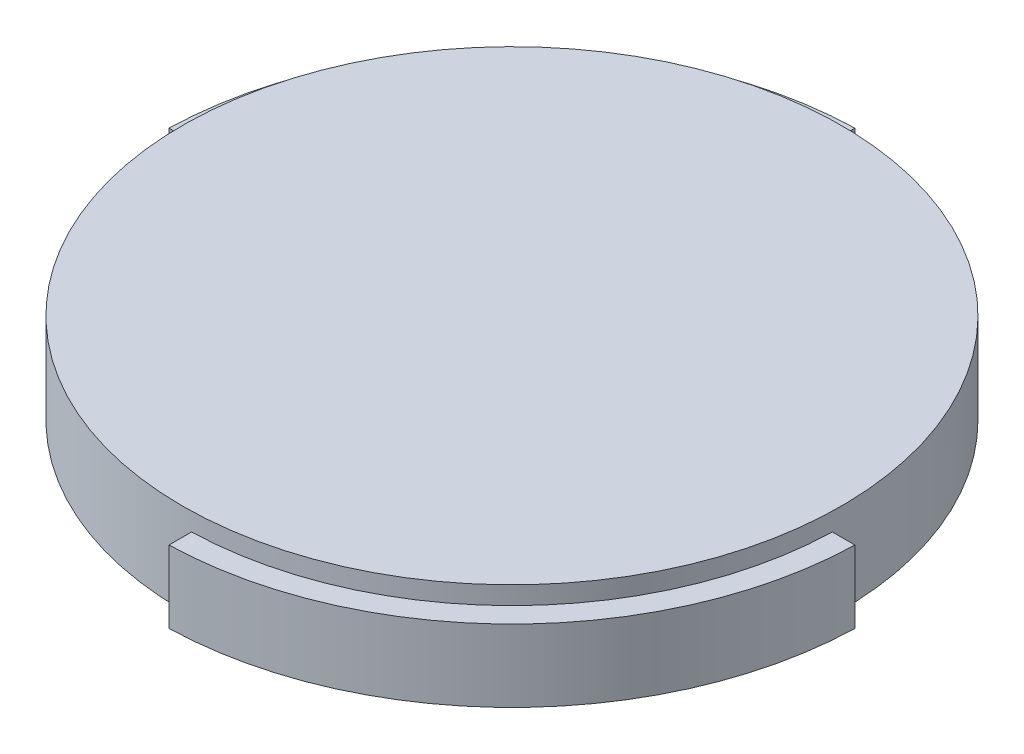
from build123d import *

# Parameters (mm, degrees)
CROQUIS1_R              = 39
SALIENTE_EXTRUIR1_DEPTH = 10
CORTAR_EXTRUIR1_START   = -2
CORTAR_EXTRUIR1_DEPTH   = 2
CORTAR_EXTRUIR2_START   = -10
CORTAR_EXTRUIR2_DEPTH   = 10


with BuildPart() as part:
    # Croquis1 → Saliente-Extruir1 (new body)
    with BuildSketch(Plane(origin=(0, 0, 0), x_dir=(1, 0, 0), z_dir=(0, 1, 0))):
        with Locations(Location((0, 0, 0), (0, 0, 270))):
            Circle(CROQUIS1_R)
    extrude(amount=SALIENTE_EXTRUIR1_DEPTH)

    # Croquis2 → Cortar-Extruir1 (cut)
    with BuildSketch(Plane(origin=(0, 10, 0), x_dir=(1, 0, 0), z_dir=(0, 1, 0)).offset(CORTAR_EXTRUIR1_START)):
        with BuildLine():
            Line((-1, 38.987177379), (-1, 36.486298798))
            ThreePointArc((-1, 36.486298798), (-25.8094307, 25.809364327), (-36.48630137, 0.999906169))
            Line((-36.48630137, 0.999906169), (-38.987179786, 0.999906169))
            ThreePointArc((-38.987179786, 0.999906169), (-27.577197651, 27.577131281), (-1, 38.987177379))
        make_face()
        with BuildLine():
            Line((38.987177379, -1), (36.486298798, -1))
            ThreePointArc((36.486298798, -1), (25.809397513, -25.809397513), (1, -36.486298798))
            Line((1, -36.486298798), (1, -38.987177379))
            ThreePointArc((1, -38.987177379), (27.577164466, -27.577164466), (38.987177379, -1))
        make_face()
    extrude(amount=CORTAR_EXTRUIR1_DEPTH, mode=Mode.SUBTRACT)

    # Croquis3 → Cortar-Extruir2 (cut)
    with BuildSketch(Plane(origin=(0, 10, 0), x_dir=(1, 0, 0), z_dir=(0, 1, 0)).offset(CORTAR_EXTRUIR2_START)):
        with BuildLine():
            Line((-1, 38.987177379), (-1, 36.486298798))
            ThreePointArc((-1, 36.486298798), (25.809397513, 25.809397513), (36.486298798, -1))
            Line((36.486298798, -1), (38.987177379, -1))
            ThreePointArc((38.987177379, -1), (27.577164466, 27.577164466), (-1, 38.987177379))
        make_face()
        with BuildLine():
            Line((-36.48630137, 0.999906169), (-38.987179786, 0.999906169))
            ThreePointArc((-38.987179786, 0.999906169), (-27.577131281, -27.577197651), (1, -38.987177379))
            Line((1, -38.987177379), (1, -36.486298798))
            ThreePointArc((1, -36.486298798), (-25.809364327, -25.8094307), (-36.48630137, 0.999906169))
        make_face()
    extrude(amount=CORTAR_EXTRUIR2_DEPTH, mode=Mode.SUBTRACT)


solid = part.part
